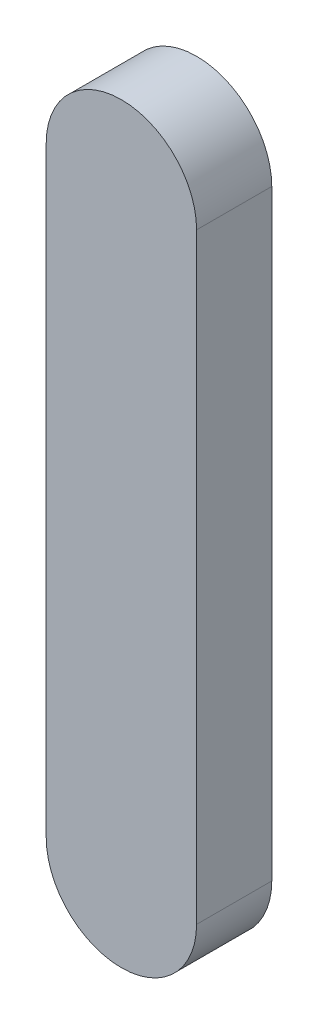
from build123d import *

# Parameters (mm, degrees)
EXTRUDE_1_DEPTH = 1.5


with BuildPart() as part:
    # Sketch 1 → Extrude 1 (new body)
    with BuildSketch(Plane.XY):
        with BuildLine():
            Line((-1.5, -4), (-1.5, -16))
            ThreePointArc((-1.5, -16), (0, -17.5), (1.5, -16))
            Line((1.5, -16), (1.5, -4))
            ThreePointArc((1.5, -4), (0, -2.5), (-1.5, -4))
        make_face()
    extrude(amount=EXTRUDE_1_DEPTH)


solid = part.part
